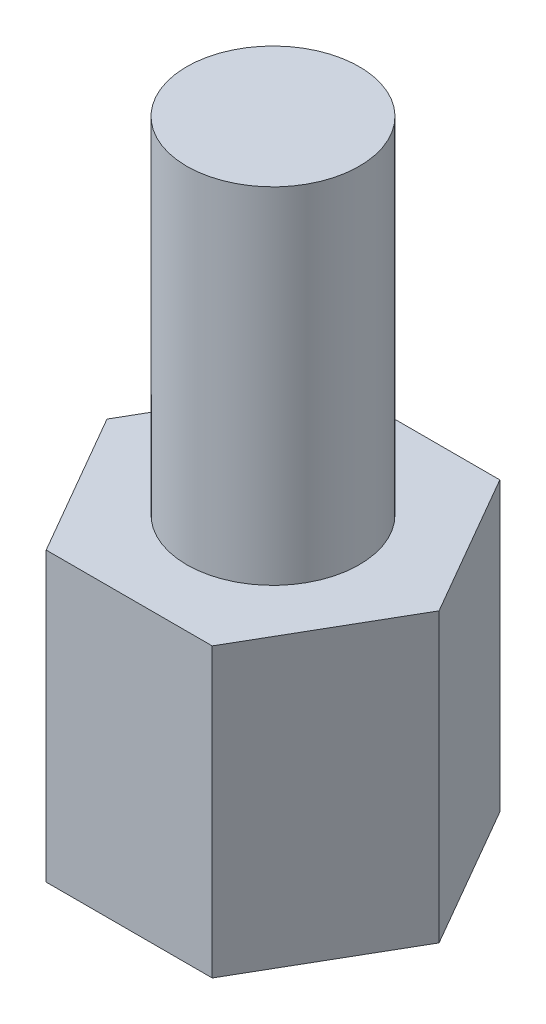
ISO-10303-21;
HEADER;
FILE_DESCRIPTION(('STEP AP214'),'2;1');
FILE_NAME('part.step','',(''),(''),'','','');
FILE_SCHEMA(('AUTOMOTIVE_DESIGN { 1 0 10303 214 1 1 1 1 }'));
ENDSEC;
DATA;
#1=APPLICATION_CONTEXT('core data for automotive mechanical design processes');
#2=APPLICATION_PROTOCOL_DEFINITION('international standard','automotive_design',2000,#1);
#3=PRODUCT_CONTEXT('',#1,'mechanical');
#4=PRODUCT('Part','Part','',(#3));
#5=PRODUCT_RELATED_PRODUCT_CATEGORY('part','',(#4));
#6=PRODUCT_DEFINITION_FORMATION('','',#4);
#7=PRODUCT_DEFINITION_CONTEXT('part definition',#1,'design');
#8=PRODUCT_DEFINITION('design','',#6,#7);
#9=PRODUCT_DEFINITION_SHAPE('','',#8);
#10=(LENGTH_UNIT() NAMED_UNIT(*) SI_UNIT(.MILLI.,.METRE.));
#11=(NAMED_UNIT(*) PLANE_ANGLE_UNIT() SI_UNIT($,.RADIAN.));
#12=(NAMED_UNIT(*) SI_UNIT($,.STERADIAN.) SOLID_ANGLE_UNIT());
#13=UNCERTAINTY_MEASURE_WITH_UNIT(LENGTH_MEASURE(1.E-05),#10,'distance_accuracy_value','');
#14=(GEOMETRIC_REPRESENTATION_CONTEXT(3) GLOBAL_UNCERTAINTY_ASSIGNED_CONTEXT((#13)) GLOBAL_UNIT_ASSIGNED_CONTEXT((#10,
#11,#12)) REPRESENTATION_CONTEXT('',''));
#15=CARTESIAN_POINT('',(0.,0.,0.));
#16=DIRECTION('',(0.,0.,1.));
#17=DIRECTION('',(1.,0.,0.));
#18=AXIS2_PLACEMENT_3D('',#15,#16,#17);
#19=CARTESIAN_POINT('',(0.,11.,0.));
#20=DIRECTION('',(0.,-1.,0.));
#21=DIRECTION('',(0.,0.,-1.));
#22=AXIS2_PLACEMENT_3D('',#19,#20,#21);
#23=CYLINDRICAL_SURFACE('',#22,1.5);
#24=CARTESIAN_POINT('',(0.,11.,0.));
#25=DIRECTION('',(0.,1.,0.));
#26=DIRECTION('',(0.,0.,1.));
#27=AXIS2_PLACEMENT_3D('',#24,#25,#26);
#28=CIRCLE('',#27,1.5);
#29=CARTESIAN_POINT('',(0.,11.,1.5));
#30=VERTEX_POINT('',#29);
#31=EDGE_CURVE('E11',#30,#30,#28,.T.);
#32=ORIENTED_EDGE('',*,*,#31,.F.);
#33=EDGE_LOOP('',(#32));
#34=FACE_BOUND('',#33,.T.);
#35=CARTESIAN_POINT('',(0.,5.,0.));
#36=DIRECTION('',(0.,1.,0.));
#37=DIRECTION('',(0.,0.,1.));
#38=AXIS2_PLACEMENT_3D('',#35,#36,#37);
#39=CIRCLE('',#38,1.5);
#40=CARTESIAN_POINT('',(0.,5.,1.5));
#41=VERTEX_POINT('',#40);
#42=EDGE_CURVE('E48',#41,#41,#39,.T.);
#43=ORIENTED_EDGE('',*,*,#42,.T.);
#44=EDGE_LOOP('',(#43));
#45=FACE_BOUND('',#44,.T.);
#46=ADVANCED_FACE('F45',(#34,#45),#23,.T.);
#47=CARTESIAN_POINT('',(0.,11.,0.));
#48=DIRECTION('',(0.,1.,0.));
#49=DIRECTION('',(0.,0.,1.));
#50=AXIS2_PLACEMENT_3D('',#47,#48,#49);
#51=PLANE('',#50);
#52=ORIENTED_EDGE('',*,*,#31,.T.);
#53=EDGE_LOOP('',(#52));
#54=FACE_BOUND('',#53,.T.);
#55=ADVANCED_FACE('F60',(#54),#51,.T.);
#56=CARTESIAN_POINT('',(0.,5.,0.));
#57=DIRECTION('',(0.,1.,0.));
#58=DIRECTION('',(0.,0.,1.));
#59=AXIS2_PLACEMENT_3D('',#56,#57,#58);
#60=PLANE('',#59);
#61=ORIENTED_EDGE('',*,*,#42,.F.);
#62=EDGE_LOOP('',(#61));
#63=FACE_BOUND('',#62,.T.);
#64=ADVANCED_FACE('F58',(#63),#60,.F.);
#65=CLOSED_SHELL('',(#46,#55,#64));
#66=MANIFOLD_SOLID_BREP('B2',#65);
#67=CARTESIAN_POINT('',(0.,5.,0.));
#68=DIRECTION('',(0.,1.,0.));
#69=DIRECTION('',(0.,0.,1.));
#70=AXIS2_PLACEMENT_3D('',#67,#68,#69);
#71=PLANE('',#70);
#72=DIRECTION('',(0.500000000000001,0.,-0.866025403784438));
#73=VECTOR('',#72,1.);
#74=CARTESIAN_POINT('',(1.44337567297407,5.,2.5));
#75=LINE('',#74,#73);
#76=CARTESIAN_POINT('',(1.44337567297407,5.,2.5));
#77=VERTEX_POINT('',#76);
#78=CARTESIAN_POINT('',(2.88675134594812,5.,0.));
#79=VERTEX_POINT('',#78);
#80=EDGE_CURVE('E182',#77,#79,#75,.T.);
#81=ORIENTED_EDGE('',*,*,#80,.T.);
#82=DIRECTION('',(-0.499999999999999,0.,-0.866025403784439));
#83=VECTOR('',#82,1.);
#84=CARTESIAN_POINT('',(2.88675134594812,5.,0.));
#85=LINE('',#84,#83);
#86=CARTESIAN_POINT('',(1.44337567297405,5.,-2.5));
#87=VERTEX_POINT('',#86);
#88=EDGE_CURVE('E140',#79,#87,#85,.T.);
#89=ORIENTED_EDGE('',*,*,#88,.T.);
#90=DIRECTION('',(-1.,0.,0.));
#91=VECTOR('',#90,1.);
#92=CARTESIAN_POINT('',(1.44337567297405,5.,-2.5));
#93=LINE('',#92,#91);
#94=CARTESIAN_POINT('',(-1.44337567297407,5.,-2.5));
#95=VERTEX_POINT('',#94);
#96=EDGE_CURVE('E153',#87,#95,#93,.T.);
#97=ORIENTED_EDGE('',*,*,#96,.T.);
#98=DIRECTION('',(-0.5,0.,0.866025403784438));
#99=VECTOR('',#98,1.);
#100=CARTESIAN_POINT('',(-1.44337567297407,5.,-2.5));
#101=LINE('',#100,#99);
#102=CARTESIAN_POINT('',(-2.88675134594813,5.,0.));
#103=VERTEX_POINT('',#102);
#104=EDGE_CURVE('E147',#95,#103,#101,.T.);
#105=ORIENTED_EDGE('',*,*,#104,.T.);
#106=DIRECTION('',(0.5,0.,0.866025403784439));
#107=VECTOR('',#106,1.);
#108=CARTESIAN_POINT('',(-2.88675134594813,5.,0.));
#109=LINE('',#108,#107);
#110=CARTESIAN_POINT('',(-1.44337567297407,5.,2.5));
#111=VERTEX_POINT('',#110);
#112=EDGE_CURVE('E151',#103,#111,#109,.T.);
#113=ORIENTED_EDGE('',*,*,#112,.T.);
#114=DIRECTION('',(1.,0.,0.));
#115=VECTOR('',#114,1.);
#116=CARTESIAN_POINT('',(-1.44337567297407,5.,2.5));
#117=LINE('',#116,#115);
#118=EDGE_CURVE('E103',#111,#77,#117,.T.);
#119=ORIENTED_EDGE('',*,*,#118,.T.);
#120=EDGE_LOOP('',(#81,#89,#97,#105,#113,#119));
#121=FACE_BOUND('',#120,.T.);
#122=CARTESIAN_POINT('',(0.,5.,0.));
#123=DIRECTION('',(0.,1.,0.));
#124=DIRECTION('',(0.,0.,1.));
#125=AXIS2_PLACEMENT_3D('',#122,#123,#124);
#126=CIRCLE('',#125,1.5);
#127=CARTESIAN_POINT('',(0.,5.,1.5));
#128=VERTEX_POINT('',#127);
#129=EDGE_CURVE('E175',#128,#128,#126,.T.);
#130=ORIENTED_EDGE('',*,*,#129,.F.);
#131=EDGE_LOOP('',(#130));
#132=FACE_BOUND('',#131,.T.);
#133=ADVANCED_FACE('F86',(#121,#132),#71,.T.);
#134=CARTESIAN_POINT('',(0.,0.,0.));
#135=DIRECTION('',(0.,1.,0.));
#136=DIRECTION('',(0.,0.,1.));
#137=AXIS2_PLACEMENT_3D('',#134,#135,#136);
#138=PLANE('',#137);
#139=DIRECTION('',(0.500000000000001,0.,-0.866025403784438));
#140=VECTOR('',#139,1.);
#141=CARTESIAN_POINT('',(1.44337567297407,0.,2.5));
#142=LINE('',#141,#140);
#143=CARTESIAN_POINT('',(1.44337567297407,0.,2.5));
#144=VERTEX_POINT('',#143);
#145=CARTESIAN_POINT('',(2.88675134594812,0.,0.));
#146=VERTEX_POINT('',#145);
#147=EDGE_CURVE('E171',#144,#146,#142,.T.);
#148=ORIENTED_EDGE('',*,*,#147,.F.);
#149=DIRECTION('',(1.,0.,0.));
#150=VECTOR('',#149,1.);
#151=CARTESIAN_POINT('',(-1.44337567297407,0.,2.5));
#152=LINE('',#151,#150);
#153=CARTESIAN_POINT('',(-1.44337567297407,0.,2.5));
#154=VERTEX_POINT('',#153);
#155=EDGE_CURVE('E132',#154,#144,#152,.T.);
#156=ORIENTED_EDGE('',*,*,#155,.F.);
#157=DIRECTION('',(0.5,0.,0.866025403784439));
#158=VECTOR('',#157,1.);
#159=CARTESIAN_POINT('',(-2.88675134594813,0.,0.));
#160=LINE('',#159,#158);
#161=CARTESIAN_POINT('',(-2.88675134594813,0.,0.));
#162=VERTEX_POINT('',#161);
#163=EDGE_CURVE('E126',#162,#154,#160,.T.);
#164=ORIENTED_EDGE('',*,*,#163,.F.);
#165=DIRECTION('',(-0.5,0.,0.866025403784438));
#166=VECTOR('',#165,1.);
#167=CARTESIAN_POINT('',(-1.44337567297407,0.,-2.5));
#168=LINE('',#167,#166);
#169=CARTESIAN_POINT('',(-1.44337567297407,0.,-2.5));
#170=VERTEX_POINT('',#169);
#171=EDGE_CURVE('E161',#170,#162,#168,.T.);
#172=ORIENTED_EDGE('',*,*,#171,.F.);
#173=DIRECTION('',(-1.,0.,0.));
#174=VECTOR('',#173,1.);
#175=CARTESIAN_POINT('',(1.44337567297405,0.,-2.5));
#176=LINE('',#175,#174);
#177=CARTESIAN_POINT('',(1.44337567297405,0.,-2.5));
#178=VERTEX_POINT('',#177);
#179=EDGE_CURVE('E177',#178,#170,#176,.T.);
#180=ORIENTED_EDGE('',*,*,#179,.F.);
#181=DIRECTION('',(-0.499999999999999,0.,-0.866025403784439));
#182=VECTOR('',#181,1.);
#183=CARTESIAN_POINT('',(2.88675134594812,0.,0.));
#184=LINE('',#183,#182);
#185=EDGE_CURVE('E174',#146,#178,#184,.T.);
#186=ORIENTED_EDGE('',*,*,#185,.F.);
#187=EDGE_LOOP('',(#148,#156,#164,#172,#180,#186));
#188=FACE_BOUND('',#187,.T.);
#189=CARTESIAN_POINT('',(0.,0.,0.));
#190=DIRECTION('',(0.,1.,0.));
#191=DIRECTION('',(0.,0.,1.));
#192=AXIS2_PLACEMENT_3D('',#189,#190,#191);
#193=CIRCLE('',#192,1.5);
#194=CARTESIAN_POINT('',(0.,0.,1.5));
#195=VERTEX_POINT('',#194);
#196=EDGE_CURVE('E275',#195,#195,#193,.T.);
#197=ORIENTED_EDGE('',*,*,#196,.T.);
#198=EDGE_LOOP('',(#197));
#199=FACE_BOUND('',#198,.T.);
#200=ADVANCED_FACE('F191',(#188,#199),#138,.F.);
#201=CARTESIAN_POINT('',(1.44337567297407,5.,2.5));
#202=DIRECTION('',(-0.866025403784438,0.,-0.500000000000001));
#203=DIRECTION('',(-0.500000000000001,0.,0.866025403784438));
#204=AXIS2_PLACEMENT_3D('',#201,#202,#203);
#205=PLANE('',#204);
#206=ORIENTED_EDGE('',*,*,#147,.T.);
#207=DIRECTION('',(0.,-1.,0.));
#208=VECTOR('',#207,1.);
#209=CARTESIAN_POINT('',(2.88675134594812,5.,0.));
#210=LINE('',#209,#208);
#211=EDGE_CURVE('E43',#79,#146,#210,.T.);
#212=ORIENTED_EDGE('',*,*,#211,.F.);
#213=ORIENTED_EDGE('',*,*,#80,.F.);
#214=DIRECTION('',(0.,-1.,0.));
#215=VECTOR('',#214,1.);
#216=CARTESIAN_POINT('',(1.44337567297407,5.,2.5));
#217=LINE('',#216,#215);
#218=EDGE_CURVE('E167',#77,#144,#217,.T.);
#219=ORIENTED_EDGE('',*,*,#218,.T.);
#220=EDGE_LOOP('',(#206,#212,#213,#219));
#221=FACE_BOUND('',#220,.T.);
#222=ADVANCED_FACE('F88',(#221),#205,.F.);
#223=CARTESIAN_POINT('',(2.88675134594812,5.,0.));
#224=DIRECTION('',(-0.866025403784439,0.,0.5));
#225=DIRECTION('',(0.5,0.,0.866025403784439));
#226=AXIS2_PLACEMENT_3D('',#223,#224,#225);
#227=PLANE('',#226);
#228=ORIENTED_EDGE('',*,*,#185,.T.);
#229=DIRECTION('',(0.,-1.,0.));
#230=VECTOR('',#229,1.);
#231=CARTESIAN_POINT('',(1.44337567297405,5.,-2.5));
#232=LINE('',#231,#230);
#233=EDGE_CURVE('E95',#87,#178,#232,.T.);
#234=ORIENTED_EDGE('',*,*,#233,.F.);
#235=ORIENTED_EDGE('',*,*,#88,.F.);
#236=ORIENTED_EDGE('',*,*,#211,.T.);
#237=EDGE_LOOP('',(#228,#234,#235,#236));
#238=FACE_BOUND('',#237,.T.);
#239=ADVANCED_FACE('F216',(#238),#227,.F.);
#240=CARTESIAN_POINT('',(1.44337567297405,5.,-2.5));
#241=DIRECTION('',(0.,0.,1.));
#242=DIRECTION('',(1.,0.,0.));
#243=AXIS2_PLACEMENT_3D('',#240,#241,#242);
#244=PLANE('',#243);
#245=ORIENTED_EDGE('',*,*,#179,.T.);
#246=DIRECTION('',(0.,-1.,0.));
#247=VECTOR('',#246,1.);
#248=CARTESIAN_POINT('',(-1.44337567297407,5.,-2.5));
#249=LINE('',#248,#247);
#250=EDGE_CURVE('E162',#95,#170,#249,.T.);
#251=ORIENTED_EDGE('',*,*,#250,.F.);
#252=ORIENTED_EDGE('',*,*,#96,.F.);
#253=ORIENTED_EDGE('',*,*,#233,.T.);
#254=EDGE_LOOP('',(#245,#251,#252,#253));
#255=FACE_BOUND('',#254,.T.);
#256=ADVANCED_FACE('F188',(#255),#244,.F.);
#257=CARTESIAN_POINT('',(-1.44337567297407,5.,-2.5));
#258=DIRECTION('',(0.866025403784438,0.,0.5));
#259=DIRECTION('',(0.5,0.,-0.866025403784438));
#260=AXIS2_PLACEMENT_3D('',#257,#258,#259);
#261=PLANE('',#260);
#262=ORIENTED_EDGE('',*,*,#171,.T.);
#263=DIRECTION('',(0.,-1.,0.));
#264=VECTOR('',#263,1.);
#265=CARTESIAN_POINT('',(-2.88675134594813,5.,0.));
#266=LINE('',#265,#264);
#267=EDGE_CURVE('E158',#103,#162,#266,.T.);
#268=ORIENTED_EDGE('',*,*,#267,.F.);
#269=ORIENTED_EDGE('',*,*,#104,.F.);
#270=ORIENTED_EDGE('',*,*,#250,.T.);
#271=EDGE_LOOP('',(#262,#268,#269,#270));
#272=FACE_BOUND('',#271,.T.);
#273=ADVANCED_FACE('F159',(#272),#261,.F.);
#274=CARTESIAN_POINT('',(-2.88675134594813,5.,0.));
#275=DIRECTION('',(0.866025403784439,0.,-0.5));
#276=DIRECTION('',(-0.5,0.,-0.866025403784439));
#277=AXIS2_PLACEMENT_3D('',#274,#275,#276);
#278=PLANE('',#277);
#279=ORIENTED_EDGE('',*,*,#163,.T.);
#280=DIRECTION('',(0.,-1.,0.));
#281=VECTOR('',#280,1.);
#282=CARTESIAN_POINT('',(-1.44337567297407,5.,2.5));
#283=LINE('',#282,#281);
#284=EDGE_CURVE('E163',#111,#154,#283,.T.);
#285=ORIENTED_EDGE('',*,*,#284,.F.);
#286=ORIENTED_EDGE('',*,*,#112,.F.);
#287=ORIENTED_EDGE('',*,*,#267,.T.);
#288=EDGE_LOOP('',(#279,#285,#286,#287));
#289=FACE_BOUND('',#288,.T.);
#290=ADVANCED_FACE('F165',(#289),#278,.F.);
#291=CARTESIAN_POINT('',(-1.44337567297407,5.,2.5));
#292=DIRECTION('',(0.,0.,-1.));
#293=DIRECTION('',(-1.,0.,0.));
#294=AXIS2_PLACEMENT_3D('',#291,#292,#293);
#295=PLANE('',#294);
#296=ORIENTED_EDGE('',*,*,#155,.T.);
#297=ORIENTED_EDGE('',*,*,#218,.F.);
#298=ORIENTED_EDGE('',*,*,#118,.F.);
#299=ORIENTED_EDGE('',*,*,#284,.T.);
#300=EDGE_LOOP('',(#296,#297,#298,#299));
#301=FACE_BOUND('',#300,.T.);
#302=ADVANCED_FACE('F196',(#301),#295,.F.);
#303=CARTESIAN_POINT('',(0.,5.,0.));
#304=DIRECTION('',(0.,-1.,0.));
#305=DIRECTION('',(0.,0.,-1.));
#306=AXIS2_PLACEMENT_3D('',#303,#304,#305);
#307=CYLINDRICAL_SURFACE('',#306,1.5);
#308=ORIENTED_EDGE('',*,*,#129,.T.);
#309=EDGE_LOOP('',(#308));
#310=FACE_BOUND('',#309,.T.);
#311=ORIENTED_EDGE('',*,*,#196,.F.);
#312=EDGE_LOOP('',(#311));
#313=FACE_BOUND('',#312,.T.);
#314=ADVANCED_FACE('F198',(#310,#313),#307,.F.);
#315=CLOSED_SHELL('',(#133,#200,#222,#239,#256,#273,#290,#302,#314));
#316=MANIFOLD_SOLID_BREP('B6',#315);
#317=ADVANCED_BREP_SHAPE_REPRESENTATION('',(#18,#66,#316),#14);
#318=SHAPE_DEFINITION_REPRESENTATION(#9,#317);
ENDSEC;
END-ISO-10303-21;
